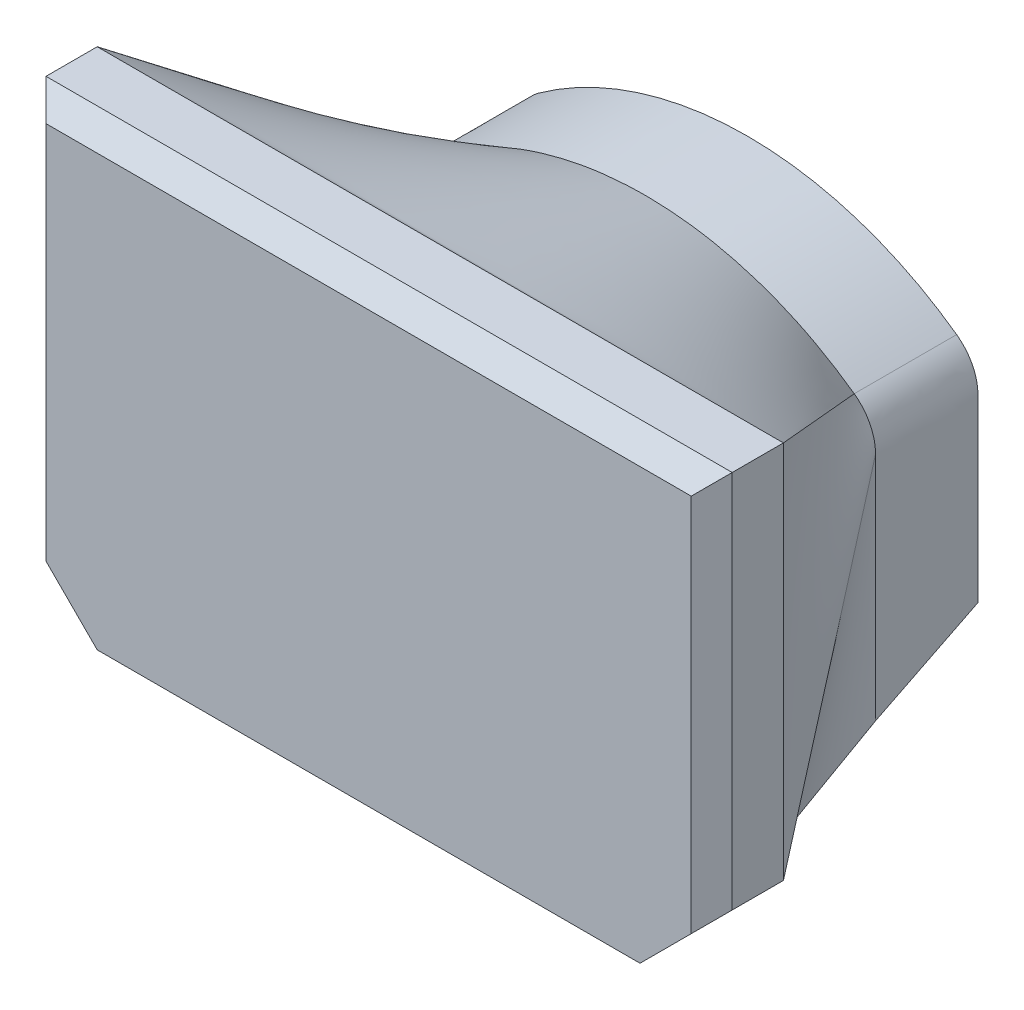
ISO-10303-21;
HEADER;
FILE_DESCRIPTION(('STEP AP214'),'2;1');
FILE_NAME('part.step','',(''),(''),'','','');
FILE_SCHEMA(('AUTOMOTIVE_DESIGN { 1 0 10303 214 1 1 1 1 }'));
ENDSEC;
DATA;
#1=APPLICATION_CONTEXT('core data for automotive mechanical design processes');
#2=APPLICATION_PROTOCOL_DEFINITION('international standard','automotive_design',2000,#1);
#3=PRODUCT_CONTEXT('',#1,'mechanical');
#4=PRODUCT('Part','Part','',(#3));
#5=PRODUCT_RELATED_PRODUCT_CATEGORY('part','',(#4));
#6=PRODUCT_DEFINITION_FORMATION('','',#4);
#7=PRODUCT_DEFINITION_CONTEXT('part definition',#1,'design');
#8=PRODUCT_DEFINITION('design','',#6,#7);
#9=PRODUCT_DEFINITION_SHAPE('','',#8);
#10=(LENGTH_UNIT() NAMED_UNIT(*) SI_UNIT(.MILLI.,.METRE.));
#11=(NAMED_UNIT(*) PLANE_ANGLE_UNIT() SI_UNIT($,.RADIAN.));
#12=(NAMED_UNIT(*) SI_UNIT($,.STERADIAN.) SOLID_ANGLE_UNIT());
#13=UNCERTAINTY_MEASURE_WITH_UNIT(LENGTH_MEASURE(1.E-05),#10,'distance_accuracy_value','');
#14=(GEOMETRIC_REPRESENTATION_CONTEXT(3) GLOBAL_UNCERTAINTY_ASSIGNED_CONTEXT((#13)) GLOBAL_UNIT_ASSIGNED_CONTEXT((#10,
#11,#12)) REPRESENTATION_CONTEXT('',''));
#15=CARTESIAN_POINT('',(0.,0.,0.));
#16=DIRECTION('',(0.,0.,1.));
#17=DIRECTION('',(1.,0.,0.));
#18=AXIS2_PLACEMENT_3D('',#15,#16,#17);
#19=CARTESIAN_POINT('',(-31.5,0.,0.));
#20=DIRECTION('',(0.,0.,-1.));
#21=DIRECTION('',(-1.,0.,0.));
#22=AXIS2_PLACEMENT_3D('',#19,#20,#21);
#23=PLANE('',#22);
#24=DIRECTION('',(1.,0.,0.));
#25=VECTOR('',#24,1.);
#26=CARTESIAN_POINT('',(-26.5,0.,0.));
#27=LINE('',#26,#25);
#28=CARTESIAN_POINT('',(-26.5,0.,0.));
#29=VERTEX_POINT('',#28);
#30=CARTESIAN_POINT('',(26.5,0.,0.));
#31=VERTEX_POINT('',#30);
#32=EDGE_CURVE('E406',#29,#31,#27,.T.);
#33=ORIENTED_EDGE('',*,*,#32,.T.);
#34=DIRECTION('',(0.707106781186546,0.707106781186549,0.));
#35=VECTOR('',#34,1.);
#36=CARTESIAN_POINT('',(26.5,0.,0.));
#37=LINE('',#36,#35);
#38=CARTESIAN_POINT('',(31.5,5.,0.));
#39=VERTEX_POINT('',#38);
#40=EDGE_CURVE('E398',#31,#39,#37,.T.);
#41=ORIENTED_EDGE('',*,*,#40,.T.);
#42=DIRECTION('',(0.,1.,0.));
#43=VECTOR('',#42,1.);
#44=CARTESIAN_POINT('',(31.5,42.,0.));
#45=LINE('',#44,#43);
#46=CARTESIAN_POINT('',(31.5,42.,0.));
#47=VERTEX_POINT('',#46);
#48=EDGE_CURVE('E380',#39,#47,#45,.T.);
#49=ORIENTED_EDGE('',*,*,#48,.T.);
#50=DIRECTION('',(-1.,0.,0.));
#51=VECTOR('',#50,1.);
#52=CARTESIAN_POINT('',(-31.5,42.,0.));
#53=LINE('',#52,#51);
#54=CARTESIAN_POINT('',(-31.5,42.,0.));
#55=VERTEX_POINT('',#54);
#56=EDGE_CURVE('E364',#47,#55,#53,.T.);
#57=ORIENTED_EDGE('',*,*,#56,.T.);
#58=DIRECTION('',(0.,-1.,0.));
#59=VECTOR('',#58,1.);
#60=CARTESIAN_POINT('',(-31.5,42.,0.));
#61=LINE('',#60,#59);
#62=CARTESIAN_POINT('',(-31.5,5.,0.));
#63=VERTEX_POINT('',#62);
#64=EDGE_CURVE('E257',#55,#63,#61,.T.);
#65=ORIENTED_EDGE('',*,*,#64,.T.);
#66=DIRECTION('',(0.707106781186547,-0.707106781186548,0.));
#67=VECTOR('',#66,1.);
#68=CARTESIAN_POINT('',(-31.5,5.,0.));
#69=LINE('',#68,#67);
#70=EDGE_CURVE('E12',#63,#29,#69,.T.);
#71=ORIENTED_EDGE('',*,*,#70,.T.);
#72=EDGE_LOOP('',(#33,#41,#49,#57,#65,#71));
#73=FACE_BOUND('',#72,.T.);
#74=ADVANCED_FACE('F242',(#73),#23,.F.);
#75=CARTESIAN_POINT('',(-26.5,0.,5.00000000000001));
#76=DIRECTION('',(-0.707106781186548,-0.707106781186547,0.));
#77=DIRECTION('',(0.707106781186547,-0.707106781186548,0.));
#78=AXIS2_PLACEMENT_3D('',#75,#76,#77);
#79=PLANE('',#78);
#80=DIRECTION('',(-0.577350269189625,0.577350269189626,-0.577350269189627));
#81=VECTOR('',#80,1.);
#82=CARTESIAN_POINT('',(-31.5,5.,0.));
#83=LINE('',#82,#81);
#84=CARTESIAN_POINT('',(-33.5,7.,-2.));
#85=VERTEX_POINT('',#84);
#86=EDGE_CURVE('E361',#63,#85,#83,.T.);
#87=ORIENTED_EDGE('',*,*,#86,.T.);
#88=DIRECTION('',(0.,0.,-1.));
#89=VECTOR('',#88,1.);
#90=CARTESIAN_POINT('',(-33.5,7.,-2.));
#91=LINE('',#90,#89);
#92=CARTESIAN_POINT('',(-33.5,7.,-7.));
#93=VERTEX_POINT('',#92);
#94=EDGE_CURVE('E675',#85,#93,#91,.T.);
#95=ORIENTED_EDGE('',*,*,#94,.T.);
#96=DIRECTION('',(0.707106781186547,-0.707106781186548,0.));
#97=VECTOR('',#96,1.);
#98=CARTESIAN_POINT('',(-33.5,7.,-7.));
#99=LINE('',#98,#97);
#100=CARTESIAN_POINT('',(-26.5,0.,-7.));
#101=VERTEX_POINT('',#100);
#102=EDGE_CURVE('E451',#93,#101,#99,.T.);
#103=ORIENTED_EDGE('',*,*,#102,.T.);
#104=DIRECTION('',(0.,0.,-1.));
#105=VECTOR('',#104,1.);
#106=CARTESIAN_POINT('',(-26.5,0.,0.));
#107=LINE('',#106,#105);
#108=EDGE_CURVE('E740',#29,#101,#107,.T.);
#109=ORIENTED_EDGE('',*,*,#108,.F.);
#110=ORIENTED_EDGE('',*,*,#70,.F.);
#111=EDGE_LOOP('',(#87,#95,#103,#109,#110));
#112=FACE_BOUND('',#111,.T.);
#113=ADVANCED_FACE('F697',(#112),#79,.T.);
#114=CARTESIAN_POINT('',(-26.5,0.,-2.));
#115=DIRECTION('',(0.,-1.,0.));
#116=DIRECTION('',(1.,0.,0.));
#117=AXIS2_PLACEMENT_3D('',#114,#115,#116);
#118=PLANE('',#117);
#119=ORIENTED_EDGE('',*,*,#108,.T.);
#120=DIRECTION('',(1.,0.,0.));
#121=VECTOR('',#120,1.);
#122=CARTESIAN_POINT('',(-26.5,0.,-7.));
#123=LINE('',#122,#121);
#124=CARTESIAN_POINT('',(26.5,0.,-7.));
#125=VERTEX_POINT('',#124);
#126=EDGE_CURVE('E421',#101,#125,#123,.T.);
#127=ORIENTED_EDGE('',*,*,#126,.T.);
#128=DIRECTION('',(0.,0.,-1.));
#129=VECTOR('',#128,1.);
#130=CARTESIAN_POINT('',(26.5,0.,0.));
#131=LINE('',#130,#129);
#132=EDGE_CURVE('E426',#31,#125,#131,.T.);
#133=ORIENTED_EDGE('',*,*,#132,.F.);
#134=ORIENTED_EDGE('',*,*,#32,.F.);
#135=EDGE_LOOP('',(#119,#127,#133,#134));
#136=FACE_BOUND('',#135,.T.);
#137=ADVANCED_FACE('F706',(#136),#118,.T.);
#138=CARTESIAN_POINT('',(-31.5,42.,0.));
#139=DIRECTION('',(-0.707106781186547,0.,0.707106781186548));
#140=DIRECTION('',(0.707106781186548,0.,0.707106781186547));
#141=AXIS2_PLACEMENT_3D('',#138,#139,#140);
#142=PLANE('',#141);
#143=DIRECTION('',(-0.577350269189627,0.577350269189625,-0.577350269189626));
#144=VECTOR('',#143,1.);
#145=CARTESIAN_POINT('',(-31.5,42.,0.));
#146=LINE('',#145,#144);
#147=CARTESIAN_POINT('',(-33.5,44.,-2.));
#148=VERTEX_POINT('',#147);
#149=EDGE_CURVE('E359',#55,#148,#146,.T.);
#150=ORIENTED_EDGE('',*,*,#149,.T.);
#151=DIRECTION('',(0.,-1.,0.));
#152=VECTOR('',#151,1.);
#153=CARTESIAN_POINT('',(-33.5,44.,-2.));
#154=LINE('',#153,#152);
#155=EDGE_CURVE('E424',#148,#85,#154,.T.);
#156=ORIENTED_EDGE('',*,*,#155,.T.);
#157=ORIENTED_EDGE('',*,*,#86,.F.);
#158=ORIENTED_EDGE('',*,*,#64,.F.);
#159=EDGE_LOOP('',(#150,#156,#157,#158));
#160=FACE_BOUND('',#159,.T.);
#161=ADVANCED_FACE('F357',(#160),#142,.T.);
#162=CARTESIAN_POINT('',(0.,10.5000000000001,31.5));
#163=DIRECTION('',(0.,0.707106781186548,0.707106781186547));
#164=DIRECTION('',(0.,-0.707106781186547,0.707106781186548));
#165=AXIS2_PLACEMENT_3D('',#162,#163,#164);
#166=PLANE('',#165);
#167=DIRECTION('',(0.577350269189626,0.577350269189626,-0.577350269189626));
#168=VECTOR('',#167,1.);
#169=CARTESIAN_POINT('',(31.5,42.,0.));
#170=LINE('',#169,#168);
#171=CARTESIAN_POINT('',(33.5,44.,-2.));
#172=VERTEX_POINT('',#171);
#173=EDGE_CURVE('E375',#47,#172,#170,.T.);
#174=ORIENTED_EDGE('',*,*,#173,.T.);
#175=DIRECTION('',(-1.,0.,0.));
#176=VECTOR('',#175,1.);
#177=CARTESIAN_POINT('',(33.5,44.,-2.));
#178=LINE('',#177,#176);
#179=EDGE_CURVE('E374',#172,#148,#178,.T.);
#180=ORIENTED_EDGE('',*,*,#179,.T.);
#181=ORIENTED_EDGE('',*,*,#149,.F.);
#182=ORIENTED_EDGE('',*,*,#56,.F.);
#183=EDGE_LOOP('',(#174,#180,#181,#182));
#184=FACE_BOUND('',#183,.T.);
#185=ADVANCED_FACE('F371',(#184),#166,.T.);
#186=CARTESIAN_POINT('',(33.5,7.,-2.));
#187=DIRECTION('',(0.707106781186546,0.,0.707106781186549));
#188=DIRECTION('',(0.707106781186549,0.,-0.707106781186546));
#189=AXIS2_PLACEMENT_3D('',#186,#187,#188);
#190=PLANE('',#189);
#191=DIRECTION('',(0.577350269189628,0.577350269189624,-0.577350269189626));
#192=VECTOR('',#191,1.);
#193=CARTESIAN_POINT('',(31.5,5.,0.));
#194=LINE('',#193,#192);
#195=CARTESIAN_POINT('',(33.5,7.,-2.));
#196=VERTEX_POINT('',#195);
#197=EDGE_CURVE('E768',#39,#196,#194,.T.);
#198=ORIENTED_EDGE('',*,*,#197,.T.);
#199=DIRECTION('',(0.,1.,0.));
#200=VECTOR('',#199,1.);
#201=CARTESIAN_POINT('',(33.5,7.,-2.));
#202=LINE('',#201,#200);
#203=EDGE_CURVE('E413',#196,#172,#202,.T.);
#204=ORIENTED_EDGE('',*,*,#203,.T.);
#205=ORIENTED_EDGE('',*,*,#173,.F.);
#206=ORIENTED_EDGE('',*,*,#48,.F.);
#207=EDGE_LOOP('',(#198,#204,#205,#206));
#208=FACE_BOUND('',#207,.T.);
#209=ADVANCED_FACE('F766',(#208),#190,.T.);
#210=CARTESIAN_POINT('',(26.5,0.,-2.));
#211=DIRECTION('',(0.707106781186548,-0.707106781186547,0.));
#212=DIRECTION('',(0.707106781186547,0.707106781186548,0.));
#213=AXIS2_PLACEMENT_3D('',#210,#211,#212);
#214=PLANE('',#213);
#215=ORIENTED_EDGE('',*,*,#132,.T.);
#216=DIRECTION('',(0.707106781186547,0.707106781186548,0.));
#217=VECTOR('',#216,1.);
#218=CARTESIAN_POINT('',(26.5,0.,-7.));
#219=LINE('',#218,#217);
#220=CARTESIAN_POINT('',(33.5,7.,-7.));
#221=VERTEX_POINT('',#220);
#222=EDGE_CURVE('E432',#125,#221,#219,.T.);
#223=ORIENTED_EDGE('',*,*,#222,.T.);
#224=DIRECTION('',(0.,0.,-1.));
#225=VECTOR('',#224,1.);
#226=CARTESIAN_POINT('',(33.5,7.,-2.));
#227=LINE('',#226,#225);
#228=EDGE_CURVE('E672',#196,#221,#227,.T.);
#229=ORIENTED_EDGE('',*,*,#228,.F.);
#230=ORIENTED_EDGE('',*,*,#197,.F.);
#231=ORIENTED_EDGE('',*,*,#40,.F.);
#232=EDGE_LOOP('',(#215,#223,#229,#230,#231));
#233=FACE_BOUND('',#232,.T.);
#234=ADVANCED_FACE('F790',(#233),#214,.T.);
#235=CARTESIAN_POINT('',(33.5,7.,-7.));
#236=DIRECTION('',(1.,0.,0.));
#237=DIRECTION('',(0.,0.,-1.));
#238=AXIS2_PLACEMENT_3D('',#235,#236,#237);
#239=PLANE('',#238);
#240=ORIENTED_EDGE('',*,*,#228,.T.);
#241=DIRECTION('',(0.,1.,0.));
#242=VECTOR('',#241,1.);
#243=CARTESIAN_POINT('',(33.5,7.,-7.));
#244=LINE('',#243,#242);
#245=CARTESIAN_POINT('',(33.5,44.,-7.));
#246=VERTEX_POINT('',#245);
#247=EDGE_CURVE('E435',#221,#246,#244,.T.);
#248=ORIENTED_EDGE('',*,*,#247,.T.);
#249=DIRECTION('',(0.,0.,-1.));
#250=VECTOR('',#249,1.);
#251=CARTESIAN_POINT('',(33.5,44.,-2.));
#252=LINE('',#251,#250);
#253=EDGE_CURVE('E436',#172,#246,#252,.T.);
#254=ORIENTED_EDGE('',*,*,#253,.F.);
#255=ORIENTED_EDGE('',*,*,#203,.F.);
#256=EDGE_LOOP('',(#240,#248,#254,#255));
#257=FACE_BOUND('',#256,.T.);
#258=ADVANCED_FACE('F707',(#257),#239,.T.);
#259=CARTESIAN_POINT('',(33.5,44.,-7.));
#260=DIRECTION('',(0.,1.,0.));
#261=DIRECTION('',(-1.,0.,0.));
#262=AXIS2_PLACEMENT_3D('',#259,#260,#261);
#263=PLANE('',#262);
#264=ORIENTED_EDGE('',*,*,#253,.T.);
#265=DIRECTION('',(-1.,0.,0.));
#266=VECTOR('',#265,1.);
#267=CARTESIAN_POINT('',(33.5,44.,-7.));
#268=LINE('',#267,#266);
#269=CARTESIAN_POINT('',(-33.5,44.,-7.));
#270=VERTEX_POINT('',#269);
#271=EDGE_CURVE('E441',#246,#270,#268,.T.);
#272=ORIENTED_EDGE('',*,*,#271,.T.);
#273=DIRECTION('',(0.,0.,-1.));
#274=VECTOR('',#273,1.);
#275=CARTESIAN_POINT('',(-33.5,44.,-2.));
#276=LINE('',#275,#274);
#277=EDGE_CURVE('E665',#148,#270,#276,.T.);
#278=ORIENTED_EDGE('',*,*,#277,.F.);
#279=ORIENTED_EDGE('',*,*,#179,.F.);
#280=EDGE_LOOP('',(#264,#272,#278,#279));
#281=FACE_BOUND('',#280,.T.);
#282=ADVANCED_FACE('F759',(#281),#263,.T.);
#283=CARTESIAN_POINT('',(-33.5,44.,-7.));
#284=DIRECTION('',(-1.,0.,0.));
#285=DIRECTION('',(0.,-1.,0.));
#286=AXIS2_PLACEMENT_3D('',#283,#284,#285);
#287=PLANE('',#286);
#288=ORIENTED_EDGE('',*,*,#277,.T.);
#289=DIRECTION('',(0.,-1.,0.));
#290=VECTOR('',#289,1.);
#291=CARTESIAN_POINT('',(-33.5,44.,-7.));
#292=LINE('',#291,#290);
#293=EDGE_CURVE('E446',#270,#93,#292,.T.);
#294=ORIENTED_EDGE('',*,*,#293,.T.);
#295=ORIENTED_EDGE('',*,*,#94,.F.);
#296=ORIENTED_EDGE('',*,*,#155,.F.);
#297=EDGE_LOOP('',(#288,#294,#295,#296));
#298=FACE_BOUND('',#297,.T.);
#299=ADVANCED_FACE('F753',(#298),#287,.T.);
#300=CARTESIAN_POINT('',(-26.5,0.,-7.));
#301=CARTESIAN_POINT('',(-22.5,5.,-27.));
#302=CARTESIAN_POINT('',(-27.6666666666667,1.16666666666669,-7.));
#303=CARTESIAN_POINT('',(-22.5,8.75957877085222,-27.));
#304=CARTESIAN_POINT('',(-28.8333333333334,2.33333333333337,-7.));
#305=CARTESIAN_POINT('',(-22.5,12.5191575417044,-27.));
#306=CARTESIAN_POINT('',(-31.1666666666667,4.6666666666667,-7.));
#307=CARTESIAN_POINT('',(-22.5,20.0383150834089,-27.));
#308=CARTESIAN_POINT('',(-32.3333333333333,5.83333333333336,-7.));
#309=CARTESIAN_POINT('',(-22.5,23.7978938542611,-27.));
#310=CARTESIAN_POINT('',(-33.5,7.,-7.));
#311=CARTESIAN_POINT('',(-22.5,27.5574726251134,-27.));
#312=B_SPLINE_SURFACE_WITH_KNOTS('',3,1,((#300,#301),(#302,#303),(#304,#305),(#306,#307),(#308,
#309),(#310,#311)),.UNSPECIFIED.,.F.,.F.,.F.,(4,2,4),(2,2),(0.,0.5,1.),(0.,1.),.UNSPECIFIED.);
#313=DIRECTION('',(0.358093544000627,0.669227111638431,-0.651079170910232));
#314=VECTOR('',#313,1.);
#315=CARTESIAN_POINT('',(-28.,17.2787363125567,-17.));
#316=LINE('',#315,#314);
#317=CARTESIAN_POINT('',(-22.4999999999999,27.5574726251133,-27.));
#318=VERTEX_POINT('',#317);
#319=EDGE_CURVE('E660',#93,#318,#316,.T.);
#320=DIRECTION('',(0.,-1.,0.));
#321=VECTOR('',#320,1.);
#322=CARTESIAN_POINT('',(-22.5,27.5574726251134,-27.));
#323=LINE('',#322,#321);
#324=CARTESIAN_POINT('',(-22.5,5.,-27.));
#325=VERTEX_POINT('',#324);
#326=EDGE_CURVE('E534',#318,#325,#323,.T.);
#327=DIRECTION('',(-0.190476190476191,-0.238095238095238,0.952380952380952));
#328=VECTOR('',#327,1.);
#329=CARTESIAN_POINT('',(-24.5,2.5,-17.));
#330=LINE('',#329,#328);
#331=EDGE_CURVE('E657',#325,#101,#330,.T.);
#332=ORIENTED_EDGE('',*,*,#102,.F.);
#333=ORIENTED_EDGE('',*,*,#319,.T.);
#334=ORIENTED_EDGE('',*,*,#326,.T.);
#335=ORIENTED_EDGE('',*,*,#331,.T.);
#336=EDGE_LOOP('',(#332,#333,#334,#335));
#337=FACE_BOUND('',#336,.T.);
#338=ADVANCED_FACE('F518',(#337),#312,.T.);
#339=CARTESIAN_POINT('',(-33.5,7.,-7.));
#340=CARTESIAN_POINT('',(-22.5,27.5574726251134,-27.));
#341=CARTESIAN_POINT('',(-22.39,27.7630473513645,-27.2));
#342=CARTESIAN_POINT('',(-33.5,10.0833333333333,-7.));
#343=CARTESIAN_POINT('',(-22.5,27.9378355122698,-27.));
#344=CARTESIAN_POINT('',(-22.39,28.1163805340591,-27.2));
#345=CARTESIAN_POINT('',(-33.5,13.1666666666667,-7.));
#346=CARTESIAN_POINT('',(-22.4560271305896,28.3289764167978,-27.));
#347=CARTESIAN_POINT('',(-22.3455874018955,28.4805995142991,-27.2));
#348=CARTESIAN_POINT('',(-33.5,19.3333333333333,-7.));
#349=CARTESIAN_POINT('',(-22.2723259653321,29.1009517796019,-27.));
#350=CARTESIAN_POINT('',(-22.1600492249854,29.1986279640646,-27.2));
#351=CARTESIAN_POINT('',(-33.5,22.4166666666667,-7.));
#352=CARTESIAN_POINT('',(-22.1325217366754,29.4814764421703,-27.));
#353=CARTESIAN_POINT('',(-22.0188469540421,29.5521245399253,-27.2));
#354=CARTESIAN_POINT('',(-33.5,28.5833333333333,-7.));
#355=CARTESIAN_POINT('',(-21.7650434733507,30.1978234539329,-27.));
#356=CARTESIAN_POINT('',(-21.6476939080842,30.2139683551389,-27.2));
#357=CARTESIAN_POINT('',(-33.5,31.6666666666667,-7.));
#358=CARTESIAN_POINT('',(-21.537521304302,30.5333497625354,-27.));
#359=CARTESIAN_POINT('',(-21.417896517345,30.522016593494,-27.2));
#360=CARTESIAN_POINT('',(-33.5,37.8333333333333,-7.));
#361=CARTESIAN_POINT('',(-21.0176565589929,31.1328768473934,-27.));
#362=CARTESIAN_POINT('',(-20.8928331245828,31.065872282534,-27.2));
#363=CARTESIAN_POINT('',(-33.5,40.9166666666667,-7.));
#364=CARTESIAN_POINT('',(-20.7256099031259,31.3967585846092,-27.));
#365=CARTESIAN_POINT('',(-20.5978660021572,31.3015595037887,-27.2));
#366=CARTESIAN_POINT('',(-33.5,44.,-7.));
#367=CARTESIAN_POINT('',(-20.4166666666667,31.6186369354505,-27.));
#368=CARTESIAN_POINT('',(-20.2858333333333,31.494823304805,-27.2));
#369=B_SPLINE_SURFACE_WITH_KNOTS('',3,1,((#339,#340,#341),(#342,#343,#344),(#345,#346,#347),
(#348,#349,#350),(#351,#352,#353),(#354,#355,#356),(#357,#358,#359),(#360,#361,#362),(#363,#364,
#365),(#366,#367,#368)),.UNSPECIFIED.,.F.,.F.,.F.,(4,2,2,2,4),(2,1,2),(0.,0.25,0.5,0.75,1.),(0.,
1.,1.01),.UNSPECIFIED.);
#370=DIRECTION('',(0.486079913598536,-0.459999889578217,-0.743052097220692));
#371=VECTOR('',#370,1.);
#372=CARTESIAN_POINT('',(-26.9583333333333,37.8093184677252,-17.));
#373=LINE('',#372,#371);
#374=CARTESIAN_POINT('',(-20.4166666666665,31.6186369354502,-27.));
#375=VERTEX_POINT('',#374);
#376=EDGE_CURVE('E645',#270,#375,#373,.T.);
#377=CARTESIAN_POINT('',(-20.4166666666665,31.6186369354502,-27.));
#378=CARTESIAN_POINT('',(-20.4737752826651,31.5776255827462,-26.9999968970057));
#379=CARTESIAN_POINT('',(-20.5300224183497,31.5354137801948,-26.9999658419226));
#380=CARTESIAN_POINT('',(-20.6406879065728,31.4486575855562,-26.9998919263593));
#381=CARTESIAN_POINT('',(-20.6951062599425,31.4041131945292,-26.9998490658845));
#382=CARTESIAN_POINT('',(-20.802005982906,31.3127621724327,-26.9997956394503));
#383=CARTESIAN_POINT('',(-20.8544874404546,31.2659556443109,-26.9997850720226));
#384=CARTESIAN_POINT('',(-20.9574209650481,31.1701631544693,-26.9998083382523));
#385=CARTESIAN_POINT('',(-21.0078730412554,31.1211772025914,-26.9998421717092));
#386=CARTESIAN_POINT('',(-21.1066099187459,31.021169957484,-26.9999410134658));
#387=CARTESIAN_POINT('',(-21.1548969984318,30.9701509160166,-27.000005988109));
#388=CARTESIAN_POINT('',(-21.2492880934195,30.8661402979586,-27.0000804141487));
#389=CARTESIAN_POINT('',(-21.2953920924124,30.8131487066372,-27.0000898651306));
#390=CARTESIAN_POINT('',(-21.4303120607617,30.6513392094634,-26.999999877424));
#391=CARTESIAN_POINT('',(-21.515759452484,30.5396628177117,-26.9997821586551));
#392=CARTESIAN_POINT('',(-21.6366243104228,30.3670334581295,-26.999657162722));
#393=CARTESIAN_POINT('',(-21.6757132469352,30.3086062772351,-26.9996491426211));
#394=CARTESIAN_POINT('',(-21.7513897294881,30.1901456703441,-26.9996960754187));
#395=CARTESIAN_POINT('',(-21.7879772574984,30.130112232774,-26.9997510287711));
#396=CARTESIAN_POINT('',(-21.8585865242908,30.0085555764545,-26.9998838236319));
#397=CARTESIAN_POINT('',(-21.8926082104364,29.9470323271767,-26.9999616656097));
#398=CARTESIAN_POINT('',(-21.9580395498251,29.8226118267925,-27.00000009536));
#399=CARTESIAN_POINT('',(-21.9894492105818,29.759714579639,-26.9999606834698));
#400=CARTESIAN_POINT('',(-22.0495728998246,29.6326759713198,-26.999848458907));
#401=CARTESIAN_POINT('',(-22.0782880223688,29.5685351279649,-26.9997756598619));
#402=CARTESIAN_POINT('',(-22.1329793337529,29.4390958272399,-26.9996926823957));
#403=CARTESIAN_POINT('',(-22.1589555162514,29.3737973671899,-26.9996825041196));
#404=CARTESIAN_POINT('',(-22.2081225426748,29.2421675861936,-26.9997435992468));
#405=CARTESIAN_POINT('',(-22.2313136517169,29.1758363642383,-26.9998148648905));
#406=CARTESIAN_POINT('',(-22.2748826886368,29.0422576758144,-26.9999916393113));
#407=CARTESIAN_POINT('',(-22.2952606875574,28.9750102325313,-27.0000971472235));
#408=CARTESIAN_POINT('',(-22.3296056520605,28.8525222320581,-27.0002013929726));
#409=CARTESIAN_POINT('',(-22.3440561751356,28.7974166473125,-27.0002165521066));
#410=CARTESIAN_POINT('',(-22.3710894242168,28.6867506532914,-27.0001232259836));
#411=CARTESIAN_POINT('',(-22.3836722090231,28.6311902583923,-27.00001474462));
#412=CARTESIAN_POINT('',(-22.4069284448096,28.5196794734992,-26.9997904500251));
#413=CARTESIAN_POINT('',(-22.417602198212,28.4637291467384,-26.9996746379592));
#414=CARTESIAN_POINT('',(-22.4370185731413,28.3514975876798,-26.9994930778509));
#415=CARTESIAN_POINT('',(-22.4457611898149,28.2952163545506,-26.9994273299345));
#416=CARTESIAN_POINT('',(-22.4690628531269,28.1259754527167,-26.9993504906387));
#417=CARTESIAN_POINT('',(-22.480700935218,28.012593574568,-26.9994597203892));
#418=CARTESIAN_POINT('',(-22.4923032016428,27.8421389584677,-26.9997031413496));
#419=CARTESIAN_POINT('',(-22.4951948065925,27.7852455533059,-26.9997975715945));
#420=CARTESIAN_POINT('',(-22.4990434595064,27.6713942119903,-26.9999459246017));
#421=CARTESIAN_POINT('',(-22.5000005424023,27.6144362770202,-26.9999998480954));
#422=CARTESIAN_POINT('',(-22.4999999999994,27.5574726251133,-27.));
#423=B_SPLINE_CURVE_WITH_KNOTS('',3,(#377,#378,#379,#380,#381,#382,#383,#384,#385,#386,#387,
#388,#389,#390,#391,#392,#393,#394,#395,#396,#397,#398,#399,#400,#401,#402,#403,#404,#405,#406,
#407,#408,#409,#410,#411,#412,#413,#414,#415,#416,#417,#418,#419,#420,#421,#422),.UNSPECIFIED.,
.F.,.F.,(4,2,2,2,2,2,2,2,2,2,2,2,2,2,2,2,2,2,2,2,2,2,4),(0.,0.210911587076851,0.42182307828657,
0.632724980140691,0.843625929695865,1.05429945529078,1.26497455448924,1.68622489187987,
1.89706865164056,2.10791393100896,2.3187635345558,2.52961253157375,2.7403755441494,
2.95113904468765,3.16188246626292,3.37262056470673,3.54349575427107,3.71436556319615,
3.88520827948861,4.05605142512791,4.39766123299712,4.56853539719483,4.73940647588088),.UNSPECIFIED.);
#424=EDGE_CURVE('E528',#375,#318,#423,.T.);
#425=ORIENTED_EDGE('',*,*,#293,.F.);
#426=ORIENTED_EDGE('',*,*,#376,.T.);
#427=ORIENTED_EDGE('',*,*,#424,.T.);
#428=ORIENTED_EDGE('',*,*,#319,.F.);
#429=EDGE_LOOP('',(#425,#426,#427,#428));
#430=FACE_BOUND('',#429,.T.);
#431=ADVANCED_FACE('F511',(#430),#369,.T.);
#432=CARTESIAN_POINT('',(-26.5,0.,-7.));
#433=DIRECTION('',(0.,-0.970142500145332,-0.242535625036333));
#434=DIRECTION('',(0.,0.242535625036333,-0.970142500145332));
#435=AXIS2_PLACEMENT_3D('',#432,#433,#434);
#436=PLANE('',#435);
#437=ORIENTED_EDGE('',*,*,#331,.F.);
#438=DIRECTION('',(1.,0.,0.));
#439=VECTOR('',#438,1.);
#440=CARTESIAN_POINT('',(-22.5,5.,-27.));
#441=LINE('',#440,#439);
#442=CARTESIAN_POINT('',(22.5,5.,-27.));
#443=VERTEX_POINT('',#442);
#444=EDGE_CURVE('E815',#325,#443,#441,.T.);
#445=ORIENTED_EDGE('',*,*,#444,.T.);
#446=DIRECTION('',(-0.190476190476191,0.238095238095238,-0.952380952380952));
#447=VECTOR('',#446,1.);
#448=CARTESIAN_POINT('',(24.5,2.5,-17.));
#449=LINE('',#448,#447);
#450=EDGE_CURVE('E465',#125,#443,#449,.T.);
#451=ORIENTED_EDGE('',*,*,#450,.F.);
#452=ORIENTED_EDGE('',*,*,#126,.F.);
#453=EDGE_LOOP('',(#437,#445,#451,#452));
#454=FACE_BOUND('',#453,.T.);
#455=ADVANCED_FACE('F502',(#454),#436,.T.);
#456=CARTESIAN_POINT('',(-33.5,44.,-7.));
#457=CARTESIAN_POINT('',(-20.4166666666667,31.6186369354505,-27.));
#458=CARTESIAN_POINT('',(-20.2858333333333,31.494823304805,-27.2));
#459=CARTESIAN_POINT('',(-30.7083333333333,44.,-7.));
#460=CARTESIAN_POINT('',(-19.0347426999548,32.6111137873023,-27.));
#461=CARTESIAN_POINT('',(-18.918006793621,32.4972249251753,-27.2));
#462=CARTESIAN_POINT('',(-27.9166666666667,44.,-7.));
#463=CARTESIAN_POINT('',(-17.5472286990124,33.5259904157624,-27.));
#464=CARTESIAN_POINT('',(-17.4435343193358,33.42125031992,-27.2));
#465=CARTESIAN_POINT('',(-22.3333333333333,44.,-7.));
#466=CARTESIAN_POINT('',(-14.3895442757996,35.1449705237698,-27.));
#467=CARTESIAN_POINT('',(-14.3101063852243,35.0564202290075,-27.2));
#468=CARTESIAN_POINT('',(-19.5416666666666,44.,-7.));
#469=CARTESIAN_POINT('',(-12.7194144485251,35.8488142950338,-27.));
#470=CARTESIAN_POINT('',(-12.6511919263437,35.7673024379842,-27.2));
#471=CARTESIAN_POINT('',(-13.9583333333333,44.,-7.));
#472=CARTESIAN_POINT('',(-9.24373646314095,36.997338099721,-27.));
#473=CARTESIAN_POINT('',(-9.19659049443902,36.9273114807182,-27.2));
#474=CARTESIAN_POINT('',(-11.1666666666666,44.,-7.));
#475=CARTESIAN_POINT('',(-7.4383551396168,37.4417830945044,-27.));
#476=CARTESIAN_POINT('',(-7.4010720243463,37.3762009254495,-27.2));
#477=CARTESIAN_POINT('',(-5.5833333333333,44.,-7.));
#478=CARTESIAN_POINT('',(-3.75518730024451,38.0384278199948,-27.));
#479=CARTESIAN_POINT('',(-3.73690583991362,37.9788120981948,-27.2));
#480=CARTESIAN_POINT('',(-2.79166666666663,44.,-7.));
#481=CARTESIAN_POINT('',(-1.87767137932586,38.190486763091,-27.));
#482=CARTESIAN_POINT('',(-1.86853142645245,38.1323916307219,-27.2));
#483=CARTESIAN_POINT('',(2.7916666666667,44.,-7.));
#484=CARTESIAN_POINT('',(1.87767137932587,38.190486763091,-27.));
#485=CARTESIAN_POINT('',(1.86853142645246,38.1323916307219,-27.2));
#486=CARTESIAN_POINT('',(5.58333333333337,44.,-7.));
#487=CARTESIAN_POINT('',(3.75518730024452,38.0384278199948,-27.));
#488=CARTESIAN_POINT('',(3.73690583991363,37.9788120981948,-27.2));
#489=CARTESIAN_POINT('',(11.1666666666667,44.,-7.));
#490=CARTESIAN_POINT('',(7.43835513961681,37.4417830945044,-27.));
#491=CARTESIAN_POINT('',(7.40107202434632,37.3762009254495,-27.2));
#492=CARTESIAN_POINT('',(13.9583333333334,44.,-7.));
#493=CARTESIAN_POINT('',(9.24373646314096,36.997338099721,-27.));
#494=CARTESIAN_POINT('',(9.19659049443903,36.9273114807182,-27.2));
#495=CARTESIAN_POINT('',(19.5416666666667,44.,-7.));
#496=CARTESIAN_POINT('',(12.7194144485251,35.8488142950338,-27.));
#497=CARTESIAN_POINT('',(12.6511919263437,35.7673024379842,-27.2));
#498=CARTESIAN_POINT('',(22.3333333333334,44.,-7.));
#499=CARTESIAN_POINT('',(14.3895442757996,35.1449705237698,-27.));
#500=CARTESIAN_POINT('',(14.3101063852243,35.0564202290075,-27.2));
#501=CARTESIAN_POINT('',(27.9166666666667,44.,-7.));
#502=CARTESIAN_POINT('',(17.5472286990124,33.5259904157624,-27.));
#503=CARTESIAN_POINT('',(17.4435343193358,33.42125031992,-27.2));
#504=CARTESIAN_POINT('',(30.7083333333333,44.,-7.));
#505=CARTESIAN_POINT('',(19.0347426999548,32.6111137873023,-27.));
#506=CARTESIAN_POINT('',(18.918006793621,32.4972249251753,-27.2));
#507=CARTESIAN_POINT('',(33.5,44.,-7.));
#508=CARTESIAN_POINT('',(20.4166666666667,31.6186369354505,-27.));
#509=CARTESIAN_POINT('',(20.2858333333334,31.494823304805,-27.2));
#510=B_SPLINE_SURFACE_WITH_KNOTS('',3,1,((#456,#457,#458),(#459,#460,#461),(#462,#463,#464),
(#465,#466,#467),(#468,#469,#470),(#471,#472,#473),(#474,#475,#476),(#477,#478,#479),(#480,#481,
#482),(#483,#484,#485),(#486,#487,#488),(#489,#490,#491),(#492,#493,#494),(#495,#496,#497),
(#498,#499,#500),(#501,#502,#503),(#504,#505,#506),(#507,#508,#509)),.UNSPECIFIED.,.F.,.F.,.F.,
(4,2,2,2,2,2,2,2,4),(2,1,2),(0.,0.125,0.25,0.375,0.5,0.625,0.75,0.875,1.),(0.,1.,1.01),.UNSPECIFIED.);
#511=DIRECTION('',(-0.486079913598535,-0.459999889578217,-0.743052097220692));
#512=VECTOR('',#511,1.);
#513=CARTESIAN_POINT('',(26.9583333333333,37.8093184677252,-17.));
#514=LINE('',#513,#512);
#515=CARTESIAN_POINT('',(20.4166666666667,31.6186369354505,-27.));
#516=VERTEX_POINT('',#515);
#517=EDGE_CURVE('E637',#246,#516,#514,.T.);
#518=CARTESIAN_POINT('',(20.4166666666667,31.6186369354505,-27.));
#519=CARTESIAN_POINT('',(20.1571865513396,31.8049916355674,-26.9999990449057));
#520=CARTESIAN_POINT('',(19.895166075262,31.9877801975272,-26.9999830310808));
#521=CARTESIAN_POINT('',(19.3662166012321,32.3461106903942,-26.9999515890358));
#522=CARTESIAN_POINT('',(19.0992876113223,32.5216526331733,-26.9999361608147));
#523=CARTESIAN_POINT('',(18.2914675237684,33.0371915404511,-26.9999368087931));
#524=CARTESIAN_POINT('',(17.7434732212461,33.366151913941,-26.9999998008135));
#525=CARTESIAN_POINT('',(16.6303560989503,33.9935750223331,-27.0001492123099));
#526=CARTESIAN_POINT('',(16.0652334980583,34.292038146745,-27.0002356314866));
#527=CARTESIAN_POINT('',(14.9196778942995,34.8575368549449,-27.0001450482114));
#528=CARTESIAN_POINT('',(14.3392504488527,35.1245836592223,-26.9999681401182));
#529=CARTESIAN_POINT('',(13.458382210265,35.501031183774,-26.9998064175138));
#530=CARTESIAN_POINT('',(13.1630407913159,35.6224984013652,-26.9997697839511));
#531=CARTESIAN_POINT('',(12.5691404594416,35.8573099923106,-26.9997214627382));
#532=CARTESIAN_POINT('',(12.2705815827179,35.970654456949,-26.9997097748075));
#533=CARTESIAN_POINT('',(11.6704758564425,36.1891252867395,-26.9996950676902));
#534=CARTESIAN_POINT('',(11.3689290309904,36.2942517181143,-26.9996920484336));
#535=CARTESIAN_POINT('',(10.7630581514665,36.4962011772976,-26.9996144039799));
#536=CARTESIAN_POINT('',(10.4587339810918,36.5930238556,-26.9995397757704));
#537=CARTESIAN_POINT('',(9.6823039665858,36.8283694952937,-26.9993712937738));
#538=CARTESIAN_POINT('',(9.20843985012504,36.9611369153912,-26.9992888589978));
#539=CARTESIAN_POINT('',(8.25551675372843,37.20656683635,-26.9993427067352));
#540=CARTESIAN_POINT('',(7.7764574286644,37.319227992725,-26.9994790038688));
#541=CARTESIAN_POINT('',(6.81399044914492,37.5242664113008,-26.9998944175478));
#542=CARTESIAN_POINT('',(6.33058272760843,37.6166433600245,-27.0001735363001));
#543=CARTESIAN_POINT('',(5.60291125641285,37.7398749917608,-27.0003375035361));
#544=CARTESIAN_POINT('',(5.35992276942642,37.7783971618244,-27.0003497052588));
#545=CARTESIAN_POINT('',(4.87318858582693,37.85031683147,-27.0002838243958));
#546=CARTESIAN_POINT('',(4.62944288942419,37.8837143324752,-27.0002057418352));
#547=CARTESIAN_POINT('',(3.89730782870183,37.9761863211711,-26.9999444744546));
#548=CARTESIAN_POINT('',(3.40792280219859,38.0275568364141,-26.9997342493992));
#549=CARTESIAN_POINT('',(2.42743709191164,38.1096386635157,-26.9994976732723));
#550=CARTESIAN_POINT('',(1.936336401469,38.1403498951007,-26.9994713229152));
#551=CARTESIAN_POINT('',(0.953287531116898,38.1810366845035,-26.9995365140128));
#552=CARTESIAN_POINT('',(0.461339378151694,38.1910128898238,-26.999628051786));
#553=CARTESIAN_POINT('',(-0.522538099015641,38.1901638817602,-26.9995795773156));
#554=CARTESIAN_POINT('',(-1.01446742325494,38.1793387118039,-26.9994395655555));
#555=CARTESIAN_POINT('',(-1.99743276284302,38.1369407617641,-26.9993529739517));
#556=CARTESIAN_POINT('',(-2.48846876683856,38.1053677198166,-26.9994063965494));
#557=CARTESIAN_POINT('',(-3.468791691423,38.0215604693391,-26.9997083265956));
#558=CARTESIAN_POINT('',(-3.95807860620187,37.9693261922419,-26.9999568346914));
#559=CARTESIAN_POINT('',(-4.69001923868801,37.8755653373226,-27.0002610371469));
#560=CARTESIAN_POINT('',(-4.933682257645,37.8417410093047,-27.0003510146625));
#561=CARTESIAN_POINT('',(-5.42024235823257,37.7689709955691,-27.0004300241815));
#562=CARTESIAN_POINT('',(-5.66313943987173,37.7300253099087,-27.0004190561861));
#563=CARTESIAN_POINT('',(-6.39051200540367,37.6055316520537,-27.0002599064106));
#564=CARTESIAN_POINT('',(-6.87369913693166,37.512323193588,-26.9999854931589));
#565=CARTESIAN_POINT('',(-7.835634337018,37.3056561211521,-26.9995558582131));
#566=CARTESIAN_POINT('',(-8.31438303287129,37.1922004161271,-26.999400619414));
#567=CARTESIAN_POINT('',(-9.26668773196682,36.9452018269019,-26.999299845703));
#568=CARTESIAN_POINT('',(-9.74024361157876,36.8116584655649,-26.9993543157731));
#569=CARTESIAN_POINT('',(-10.6812065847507,36.5246988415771,-26.9994650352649));
#570=CARTESIAN_POINT('',(-11.1486147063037,36.371285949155,-26.9995212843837));
#571=CARTESIAN_POINT('',(-12.0764903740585,36.0448694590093,-26.9996017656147));
#572=CARTESIAN_POINT('',(-12.5369585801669,35.8718677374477,-26.9996260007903));
#573=CARTESIAN_POINT('',(-13.4317143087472,35.5140090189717,-26.999769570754));
#574=CARTESIAN_POINT('',(-13.8663072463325,35.3299150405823,-26.9998850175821));
#575=CARTESIAN_POINT('',(-14.7276345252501,34.9443547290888,-27.0001341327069));
#576=CARTESIAN_POINT('',(-15.1543701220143,34.7428912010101,-27.0002677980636));
#577=CARTESIAN_POINT('',(-15.9993273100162,34.322919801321,-27.0003617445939));
#578=CARTESIAN_POINT('',(-16.4175495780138,34.1044132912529,-27.0003220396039));
#579=CARTESIAN_POINT('',(-17.2442442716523,33.6510166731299,-27.0001980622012));
#580=CARTESIAN_POINT('',(-17.6527297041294,33.4161502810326,-27.0001138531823));
#581=CARTESIAN_POINT('',(-18.4599229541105,32.9301080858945,-27.0000080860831));
#582=CARTESIAN_POINT('',(-18.858630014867,32.678931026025,-26.9999865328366));
#583=CARTESIAN_POINT('',(-19.6456373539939,32.1606351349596,-26.9999761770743));
#584=CARTESIAN_POINT('',(-20.033935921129,31.8935137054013,-26.9999873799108));
#585=CARTESIAN_POINT('',(-20.4166666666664,31.6186369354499,-27.));
#586=B_SPLINE_CURVE_WITH_KNOTS('',3,(#518,#519,#520,#521,#522,#523,#524,#525,#526,#527,#528,
#529,#530,#531,#532,#533,#534,#535,#536,#537,#538,#539,#540,#541,#542,#543,#544,#545,#546,#547,
#548,#549,#550,#551,#552,#553,#554,#555,#556,#557,#558,#559,#560,#561,#562,#563,#564,#565,#566,
#567,#568,#569,#570,#571,#572,#573,#574,#575,#576,#577,#578,#579,#580,#581,#582,#583,#584,#585),
.UNSPECIFIED.,.F.,.F.,(4,2,2,2,2,2,2,2,2,2,2,2,2,2,2,2,2,2,2,2,2,2,2,2,2,2,2,2,2,2,2,2,2,4),(0.,
0.958331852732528,1.91666213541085,3.83306419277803,5.74944177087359,7.66513281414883,
8.62306863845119,9.58099369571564,10.5389110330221,11.4968686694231,12.9727353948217,
14.4487007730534,15.9246889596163,16.6627113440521,17.4007335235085,18.8764808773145,
20.3522339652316,21.8279409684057,23.3036448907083,24.7793674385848,26.2550948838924,
26.9930463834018,27.7309978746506,29.2068092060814,30.6824086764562,32.1580432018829,
33.6334277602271,35.1086711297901,36.5242176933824,37.9395360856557,39.3547415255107,
40.7679364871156,42.1812404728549,43.5947754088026),.UNSPECIFIED.);
#587=EDGE_CURVE('E246',#516,#375,#586,.T.);
#588=ORIENTED_EDGE('',*,*,#271,.F.);
#589=ORIENTED_EDGE('',*,*,#517,.T.);
#590=ORIENTED_EDGE('',*,*,#587,.T.);
#591=ORIENTED_EDGE('',*,*,#376,.F.);
#592=EDGE_LOOP('',(#588,#589,#590,#591));
#593=FACE_BOUND('',#592,.T.);
#594=ADVANCED_FACE('F488',(#593),#510,.T.);
#595=CARTESIAN_POINT('',(33.5,44.,-7.));
#596=CARTESIAN_POINT('',(20.4166666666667,31.6186369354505,-27.));
#597=CARTESIAN_POINT('',(20.2858333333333,31.494823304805,-27.2));
#598=CARTESIAN_POINT('',(33.5,40.9166666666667,-7.));
#599=CARTESIAN_POINT('',(20.7256099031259,31.3967585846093,-27.));
#600=CARTESIAN_POINT('',(20.5978660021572,31.3015595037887,-27.2));
#601=CARTESIAN_POINT('',(33.5,37.8333333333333,-7.));
#602=CARTESIAN_POINT('',(21.0176565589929,31.1328768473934,-27.));
#603=CARTESIAN_POINT('',(20.8928331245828,31.065872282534,-27.2));
#604=CARTESIAN_POINT('',(33.5,31.6666666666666,-7.));
#605=CARTESIAN_POINT('',(21.537521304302,30.5333497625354,-27.));
#606=CARTESIAN_POINT('',(21.417896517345,30.5220165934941,-27.2));
#607=CARTESIAN_POINT('',(33.5,28.5833333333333,-7.));
#608=CARTESIAN_POINT('',(21.7650434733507,30.1978234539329,-27.));
#609=CARTESIAN_POINT('',(21.6476939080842,30.2139683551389,-27.2));
#610=CARTESIAN_POINT('',(33.5,22.4166666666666,-7.));
#611=CARTESIAN_POINT('',(22.1325217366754,29.4814764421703,-27.));
#612=CARTESIAN_POINT('',(22.0188469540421,29.5521245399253,-27.2));
#613=CARTESIAN_POINT('',(33.5,19.3333333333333,-7.));
#614=CARTESIAN_POINT('',(22.2723259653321,29.100951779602,-27.));
#615=CARTESIAN_POINT('',(22.1600492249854,29.1986279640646,-27.2));
#616=CARTESIAN_POINT('',(33.5,13.1666666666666,-7.));
#617=CARTESIAN_POINT('',(22.4560271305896,28.3289764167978,-27.));
#618=CARTESIAN_POINT('',(22.3455874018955,28.4805995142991,-27.2));
#619=CARTESIAN_POINT('',(33.5,10.0833333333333,-7.));
#620=CARTESIAN_POINT('',(22.5,27.9378355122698,-27.));
#621=CARTESIAN_POINT('',(22.39,28.1163805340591,-27.2));
#622=CARTESIAN_POINT('',(33.5,7.,-7.));
#623=CARTESIAN_POINT('',(22.5,27.5574726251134,-27.));
#624=CARTESIAN_POINT('',(22.39,27.7630473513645,-27.2));
#625=B_SPLINE_SURFACE_WITH_KNOTS('',3,1,((#595,#596,#597),(#598,#599,#600),(#601,#602,#603),
(#604,#605,#606),(#607,#608,#609),(#610,#611,#612),(#613,#614,#615),(#616,#617,#618),(#619,#620,
#621),(#622,#623,#624)),.UNSPECIFIED.,.F.,.F.,.F.,(4,2,2,2,4),(2,1,2),(0.,0.25,0.5,0.75,1.),(0.,
1.,1.01),.UNSPECIFIED.);
#626=DIRECTION('',(-0.358093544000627,0.669227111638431,-0.651079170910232));
#627=VECTOR('',#626,1.);
#628=CARTESIAN_POINT('',(28.,17.2787363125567,-17.));
#629=LINE('',#628,#627);
#630=CARTESIAN_POINT('',(22.4999999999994,27.5574726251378,-27.));
#631=VERTEX_POINT('',#630);
#632=EDGE_CURVE('E646',#221,#631,#629,.T.);
#633=CARTESIAN_POINT('',(22.4999999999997,27.5574726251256,-27.));
#634=CARTESIAN_POINT('',(22.5000047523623,27.6233847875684,-26.9999960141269));
#635=CARTESIAN_POINT('',(22.4987426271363,27.6892992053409,-26.9998848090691));
#636=CARTESIAN_POINT('',(22.4936346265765,27.8210313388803,-26.9995954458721));
#637=CARTESIAN_POINT('',(22.4897885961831,27.8868490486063,-26.9994172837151));
#638=CARTESIAN_POINT('',(22.4794642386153,28.0182600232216,-26.9991415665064));
#639=CARTESIAN_POINT('',(22.4729866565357,28.0838533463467,-26.9990439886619));
#640=CARTESIAN_POINT('',(22.4573880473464,28.214722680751,-26.9990142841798));
#641=CARTESIAN_POINT('',(22.4482671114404,28.2799987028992,-26.9990821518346));
#642=CARTESIAN_POINT('',(22.4274110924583,28.410089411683,-26.9993724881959));
#643=CARTESIAN_POINT('',(22.4156776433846,28.4749043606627,-26.9995948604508));
#644=CARTESIAN_POINT('',(22.3896478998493,28.6040183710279,-27.0000755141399));
#645=CARTESIAN_POINT('',(22.3753515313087,28.6683174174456,-27.000333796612));
#646=CARTESIAN_POINT('',(22.3443016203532,28.7963274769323,-27.0005790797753));
#647=CARTESIAN_POINT('',(22.3275477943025,28.8600384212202,-27.0005660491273));
#648=CARTESIAN_POINT('',(22.2915848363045,28.9867632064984,-27.0003933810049));
#649=CARTESIAN_POINT('',(22.2723757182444,29.0497770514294,-27.0002337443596));
#650=CARTESIAN_POINT('',(22.2300688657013,29.1793454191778,-26.9999260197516));
#651=CARTESIAN_POINT('',(22.2067937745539,29.2458421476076,-26.999779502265));
#652=CARTESIAN_POINT('',(22.1574372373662,29.3777867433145,-26.9995964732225));
#653=CARTESIAN_POINT('',(22.1313557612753,29.4432345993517,-26.9995599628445));
#654=CARTESIAN_POINT('',(22.076427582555,29.5729566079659,-26.999590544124));
#655=CARTESIAN_POINT('',(22.0475809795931,29.6372308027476,-26.9996576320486));
#656=CARTESIAN_POINT('',(21.9871922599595,29.7645003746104,-26.9997620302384));
#657=CARTESIAN_POINT('',(21.9556501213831,29.8274957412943,-26.9997993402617));
#658=CARTESIAN_POINT('',(21.8899464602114,29.9520941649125,-26.9997657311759));
#659=CARTESIAN_POINT('',(21.8557853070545,30.0136974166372,-26.9996948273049));
#660=CARTESIAN_POINT('',(21.7848718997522,30.1353937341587,-26.9996223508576));
#661=CARTESIAN_POINT('',(21.7481196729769,30.1954868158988,-26.999620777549));
#662=CARTESIAN_POINT('',(21.6720890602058,30.3140530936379,-26.9997072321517));
#663=CARTESIAN_POINT('',(21.6328106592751,30.3725262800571,-26.9997952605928));
#664=CARTESIAN_POINT('',(21.5518138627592,30.4877568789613,-27.0000115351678));
#665=CARTESIAN_POINT('',(21.5100954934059,30.5445143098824,-27.0001397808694));
#666=CARTESIAN_POINT('',(21.4299509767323,30.6489000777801,-27.000327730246));
#667=CARTESIAN_POINT('',(21.3918113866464,30.6967488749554,-27.000394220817));
#668=CARTESIAN_POINT('',(21.3138558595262,30.7910595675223,-27.0003698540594));
#669=CARTESIAN_POINT('',(21.2740399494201,30.837521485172,-27.0002789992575));
#670=CARTESIAN_POINT('',(21.1927589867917,30.9289675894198,-27.0000269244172));
#671=CARTESIAN_POINT('',(21.1512942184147,30.9739520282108,-26.9998657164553));
#672=CARTESIAN_POINT('',(21.0667289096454,31.0623495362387,-26.9996014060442));
#673=CARTESIAN_POINT('',(21.0236283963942,31.1057626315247,-26.9994983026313));
#674=CARTESIAN_POINT('',(20.8919065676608,31.233548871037,-26.9993367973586));
#675=CARTESIAN_POINT('',(20.8008675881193,31.3154660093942,-26.9994262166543));
#676=CARTESIAN_POINT('',(20.6599495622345,31.4330900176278,-26.9996749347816));
#677=CARTESIAN_POINT('',(20.6122368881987,31.471432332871,-26.9997769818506));
#678=CARTESIAN_POINT('',(20.5154514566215,31.5463552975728,-26.9999395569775));
#679=CARTESIAN_POINT('',(20.4663787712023,31.5829360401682,-27.0000000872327));
#680=CARTESIAN_POINT('',(20.4166666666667,31.6186369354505,-27.));
#681=B_SPLINE_CURVE_WITH_KNOTS('',3,(#633,#634,#635,#636,#637,#638,#639,#640,#641,#642,#643,
#644,#645,#646,#647,#648,#649,#650,#651,#652,#653,#654,#655,#656,#657,#658,#659,#660,#661,#662,
#663,#664,#665,#666,#667,#668,#669,#670,#671,#672,#673,#674,#675,#676,#677,#678,#679,#680),
.UNSPECIFIED.,.F.,.F.,(4,2,2,2,2,2,2,2,2,2,2,2,2,2,2,2,2,2,2,2,2,2,2,4),(0.,0.197727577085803,
0.395467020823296,0.593150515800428,0.790827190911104,0.988380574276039,1.18593966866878,
1.38352158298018,1.58110237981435,1.79239604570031,2.00369197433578,2.21498028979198,
2.42627032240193,2.63753060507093,2.84878865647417,3.06004795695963,3.27130498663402,
3.45483460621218,3.63836127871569,3.82185646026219,4.00534859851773,4.37234471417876,
4.55594145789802,4.73952848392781),.UNSPECIFIED.);
#682=EDGE_CURVE('E462',#631,#516,#681,.T.);
#683=ORIENTED_EDGE('',*,*,#247,.F.);
#684=ORIENTED_EDGE('',*,*,#632,.T.);
#685=ORIENTED_EDGE('',*,*,#682,.T.);
#686=ORIENTED_EDGE('',*,*,#517,.F.);
#687=EDGE_LOOP('',(#683,#684,#685,#686));
#688=FACE_BOUND('',#687,.T.);
#689=ADVANCED_FACE('F481',(#688),#625,.T.);
#690=CARTESIAN_POINT('',(33.5,6.99999999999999,-7.));
#691=CARTESIAN_POINT('',(22.5,27.5574726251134,-27.));
#692=CARTESIAN_POINT('',(32.3333333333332,5.83333333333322,-7.));
#693=CARTESIAN_POINT('',(22.5,23.7978938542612,-27.));
#694=CARTESIAN_POINT('',(31.1666666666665,4.6666666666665,-7.));
#695=CARTESIAN_POINT('',(22.5,20.0383150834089,-27.));
#696=CARTESIAN_POINT('',(28.8333333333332,2.33333333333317,-7.));
#697=CARTESIAN_POINT('',(22.5,12.5191575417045,-27.));
#698=CARTESIAN_POINT('',(27.6666666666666,1.16666666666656,-7.));
#699=CARTESIAN_POINT('',(22.5,8.75957877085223,-27.));
#700=CARTESIAN_POINT('',(26.5,0.,-7.));
#701=CARTESIAN_POINT('',(22.5,5.,-27.));
#702=B_SPLINE_SURFACE_WITH_KNOTS('',3,1,((#690,#691),(#692,#693),(#694,#695),(#696,#697),(#698,
#699),(#700,#701)),.UNSPECIFIED.,.F.,.F.,.F.,(4,2,4),(2,2),(0.,0.5,1.),(0.,1.),.UNSPECIFIED.);
#703=DIRECTION('',(0.,1.,0.));
#704=VECTOR('',#703,1.);
#705=CARTESIAN_POINT('',(22.5,27.5574726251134,-27.));
#706=LINE('',#705,#704);
#707=EDGE_CURVE('E473',#443,#631,#706,.T.);
#708=ORIENTED_EDGE('',*,*,#222,.F.);
#709=ORIENTED_EDGE('',*,*,#450,.T.);
#710=ORIENTED_EDGE('',*,*,#707,.T.);
#711=ORIENTED_EDGE('',*,*,#632,.F.);
#712=EDGE_LOOP('',(#708,#709,#710,#711));
#713=FACE_BOUND('',#712,.T.);
#714=ADVANCED_FACE('F487',(#713),#702,.T.);
#715=CARTESIAN_POINT('',(17.5,27.5574726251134,-37.));
#716=DIRECTION('',(0.,0.,-1.));
#717=DIRECTION('',(-1.,0.,0.));
#718=AXIS2_PLACEMENT_3D('',#715,#716,#717);
#719=PLANE('',#718);
#720=CARTESIAN_POINT('',(17.5,27.5574726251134,-37.));
#721=DIRECTION('',(0.,0.,-1.));
#722=DIRECTION('',(-1.,0.,0.));
#723=AXIS2_PLACEMENT_3D('',#720,#721,#722);
#724=CIRCLE('',#723,5.);
#725=CARTESIAN_POINT('',(20.4166666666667,31.6186369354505,-37.));
#726=VERTEX_POINT('',#725);
#727=CARTESIAN_POINT('',(22.5,27.5574726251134,-37.));
#728=VERTEX_POINT('',#727);
#729=EDGE_CURVE('E630',#726,#728,#724,.T.);
#730=ORIENTED_EDGE('',*,*,#729,.T.);
#731=DIRECTION('',(0.,-1.,0.));
#732=VECTOR('',#731,1.);
#733=CARTESIAN_POINT('',(22.5,27.5574726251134,-37.));
#734=LINE('',#733,#732);
#735=CARTESIAN_POINT('',(22.5,10.,-37.));
#736=VERTEX_POINT('',#735);
#737=EDGE_CURVE('E623',#728,#736,#734,.T.);
#738=ORIENTED_EDGE('',*,*,#737,.T.);
#739=DIRECTION('',(-1.,0.,0.));
#740=VECTOR('',#739,1.);
#741=CARTESIAN_POINT('',(22.5,10.,-37.));
#742=LINE('',#741,#740);
#743=CARTESIAN_POINT('',(-22.5,10.,-37.));
#744=VERTEX_POINT('',#743);
#745=EDGE_CURVE('E583',#736,#744,#742,.T.);
#746=ORIENTED_EDGE('',*,*,#745,.T.);
#747=DIRECTION('',(0.,1.,0.));
#748=VECTOR('',#747,1.);
#749=CARTESIAN_POINT('',(-22.5,10.,-37.));
#750=LINE('',#749,#748);
#751=CARTESIAN_POINT('',(-22.5,27.557472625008,-37.));
#752=VERTEX_POINT('',#751);
#753=EDGE_CURVE('E294',#744,#752,#750,.T.);
#754=ORIENTED_EDGE('',*,*,#753,.T.);
#755=CARTESIAN_POINT('',(-17.5,27.5574726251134,-37.));
#756=DIRECTION('',(0.,0.,-1.));
#757=DIRECTION('',(-1.,0.,0.));
#758=AXIS2_PLACEMENT_3D('',#755,#756,#757);
#759=CIRCLE('',#758,5.);
#760=CARTESIAN_POINT('',(-20.4166666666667,31.6186369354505,-37.));
#761=VERTEX_POINT('',#760);
#762=EDGE_CURVE('E574',#752,#761,#759,.T.);
#763=ORIENTED_EDGE('',*,*,#762,.T.);
#764=CARTESIAN_POINT('',(0.,3.19048676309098,-37.));
#765=DIRECTION('',(0.,0.,-1.));
#766=DIRECTION('',(-1.,0.,0.));
#767=AXIS2_PLACEMENT_3D('',#764,#765,#766);
#768=CIRCLE('',#767,35.);
#769=EDGE_CURVE('E575',#761,#726,#768,.T.);
#770=ORIENTED_EDGE('',*,*,#769,.T.);
#771=EDGE_LOOP('',(#730,#738,#746,#754,#763,#770));
#772=FACE_BOUND('',#771,.T.);
#773=ADVANCED_FACE('F543',(#772),#719,.T.);
#774=CARTESIAN_POINT('',(20.4166666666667,31.6186369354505,-26.9));
#775=CARTESIAN_POINT('',(20.4166666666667,31.6186369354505,-27.));
#776=CARTESIAN_POINT('',(20.4166666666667,31.6186369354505,-37.));
#777=CARTESIAN_POINT('',(20.7717739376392,31.3636042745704,-26.9));
#778=CARTESIAN_POINT('',(20.7711246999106,31.3640705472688,-27.));
#779=CARTESIAN_POINT('',(20.7062009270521,31.4106978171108,-37.));
#780=CARTESIAN_POINT('',(21.3577195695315,30.806622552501,-26.9));
#781=CARTESIAN_POINT('',(21.3569590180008,30.8075837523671,-27.));
#782=CARTESIAN_POINT('',(21.2809038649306,30.9037037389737,-37.));
#783=CARTESIAN_POINT('',(21.9865051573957,29.8590012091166,-26.9));
#784=CARTESIAN_POINT('',(21.9866137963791,29.8590569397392,-27.));
#785=CARTESIAN_POINT('',(21.9974776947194,29.8646300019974,-37.0000000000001));
#786=CARTESIAN_POINT('',(22.3894027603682,28.7955017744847,-26.9));
#787=CARTESIAN_POINT('',(22.3897398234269,28.7943233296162,-27.));
#788=CARTESIAN_POINT('',(22.4234461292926,28.6764788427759,-37.));
#789=CARTESIAN_POINT('',(22.5,27.9946714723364,-26.9));
#790=CARTESIAN_POINT('',(22.5,27.9938721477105,-27.));
#791=CARTESIAN_POINT('',(22.5,27.9139396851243,-37.));
#792=CARTESIAN_POINT('',(22.5,25.7157283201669,-26.9));
#793=CARTESIAN_POINT('',(22.5,25.7190956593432,-27.));
#794=CARTESIAN_POINT('',(22.5,26.0558295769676,-37.));
#795=CARTESIAN_POINT('',(22.5,21.9709936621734,-26.9));
#796=CARTESIAN_POINT('',(22.5,21.9822958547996,-27.));
#797=CARTESIAN_POINT('',(22.5,23.1125151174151,-37.));
#798=CARTESIAN_POINT('',(22.5,16.2537363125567,-26.9));
#799=CARTESIAN_POINT('',(22.5,16.2787363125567,-27.));
#800=CARTESIAN_POINT('',(22.5,18.7787363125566,-37.));
#801=CARTESIAN_POINT('',(22.5,10.53647896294,-26.9));
#802=CARTESIAN_POINT('',(22.5,10.5751767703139,-27.));
#803=CARTESIAN_POINT('',(22.5,14.4449575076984,-37.));
#804=CARTESIAN_POINT('',(22.5,6.79174430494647,-26.9));
#805=CARTESIAN_POINT('',(22.5,6.83837696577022,-27.));
#806=CARTESIAN_POINT('',(22.5,11.5016430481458,-37.));
#807=CARTESIAN_POINT('',(22.5,4.95,-26.9));
#808=CARTESIAN_POINT('',(22.5,5.,-27.));
#809=CARTESIAN_POINT('',(22.5,10.,-37.));
#810=B_SPLINE_SURFACE_WITH_KNOTS('',3,1,((#774,#775,#776),(#777,#778,#779),(#780,#781,#782),
(#783,#784,#785),(#786,#787,#788),(#789,#790,#791),(#792,#793,#794),(#795,#796,#797),(#798,#799,
#800),(#801,#802,#803),(#804,#805,#806),(#807,#808,#809)),.UNSPECIFIED.,.F.,.F.,.F.,(4,1,1,1,2,
1,1,1,4),(2,1,2),(0.,0.0479609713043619,0.0959219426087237,0.143882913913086,0.191843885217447,
0.393882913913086,0.595921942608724,0.797960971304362,1.),(-0.01,0.,1.),.UNSPECIFIED.);
#811=DIRECTION('',(0.,0.447213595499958,-0.894427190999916));
#812=VECTOR('',#811,1.);
#813=CARTESIAN_POINT('',(22.5,7.5,-32.));
#814=LINE('',#813,#812);
#815=EDGE_CURVE('E828',#443,#736,#814,.T.);
#816=DIRECTION('',(0.,0.,1.));
#817=VECTOR('',#816,1.);
#818=CARTESIAN_POINT('',(20.4166666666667,31.6186369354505,-32.));
#819=LINE('',#818,#817);
#820=EDGE_CURVE('E830',#726,#516,#819,.T.);
#821=ORIENTED_EDGE('',*,*,#682,.F.);
#822=ORIENTED_EDGE('',*,*,#707,.F.);
#823=ORIENTED_EDGE('',*,*,#815,.T.);
#824=ORIENTED_EDGE('',*,*,#737,.F.);
#825=ORIENTED_EDGE('',*,*,#729,.F.);
#826=ORIENTED_EDGE('',*,*,#820,.T.);
#827=EDGE_LOOP('',(#821,#822,#823,#824,#825,#826));
#828=FACE_BOUND('',#827,.T.);
#829=ADVANCED_FACE('F475',(#828),#810,.T.);
#830=CARTESIAN_POINT('',(22.5,5.,-27.));
#831=DIRECTION('',(0.,-0.894427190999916,-0.447213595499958));
#832=DIRECTION('',(-1.,0.,0.));
#833=AXIS2_PLACEMENT_3D('',#830,#831,#832);
#834=PLANE('',#833);
#835=ORIENTED_EDGE('',*,*,#444,.F.);
#836=DIRECTION('',(0.,0.447213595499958,-0.894427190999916));
#837=VECTOR('',#836,1.);
#838=CARTESIAN_POINT('',(-22.5,7.5,-32.));
#839=LINE('',#838,#837);
#840=EDGE_CURVE('E834',#325,#744,#839,.T.);
#841=ORIENTED_EDGE('',*,*,#840,.T.);
#842=ORIENTED_EDGE('',*,*,#745,.F.);
#843=ORIENTED_EDGE('',*,*,#815,.F.);
#844=EDGE_LOOP('',(#835,#841,#842,#843));
#845=FACE_BOUND('',#844,.T.);
#846=ADVANCED_FACE('F542',(#845),#834,.T.);
#847=CARTESIAN_POINT('',(-22.5,4.95,-26.9));
#848=CARTESIAN_POINT('',(-22.5,5.,-27.));
#849=CARTESIAN_POINT('',(-22.5,10.,-37.));
#850=CARTESIAN_POINT('',(-22.5,6.68303620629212,-26.9));
#851=CARTESIAN_POINT('',(-22.5,6.73172737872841,-27.));
#852=CARTESIAN_POINT('',(-22.5,11.6008446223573,-37.));
#853=CARTESIAN_POINT('',(-22.5,10.2972007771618,-26.9));
#854=CARTESIAN_POINT('',(-22.5,10.3400076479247,-27.));
#855=CARTESIAN_POINT('',(-22.5,14.6206947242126,-37.));
#856=CARTESIAN_POINT('',(-22.5,16.0497424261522,-26.9));
#857=CARTESIAN_POINT('',(-22.5,16.0781298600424,-27.));
#858=CARTESIAN_POINT('',(-22.5,18.9168732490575,-37.));
#859=CARTESIAN_POINT('',(-22.5,21.9123405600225,-26.9));
#860=CARTESIAN_POINT('',(-22.5,21.9246713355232,-27.));
#861=CARTESIAN_POINT('',(-22.5,23.1577488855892,-37.));
#862=CARTESIAN_POINT('',(-22.5,25.7157283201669,-26.9));
#863=CARTESIAN_POINT('',(-22.5,25.7190956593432,-27.));
#864=CARTESIAN_POINT('',(-22.5,26.0558295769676,-37.));
#865=CARTESIAN_POINT('',(-22.5,27.9946714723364,-26.9));
#866=CARTESIAN_POINT('',(-22.5,27.9938721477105,-27.));
#867=CARTESIAN_POINT('',(-22.5,27.9139396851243,-37.));
#868=CARTESIAN_POINT('',(-22.3874073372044,28.8184329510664,-26.9));
#869=CARTESIAN_POINT('',(-22.3877629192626,28.8168586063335,-27.));
#870=CARTESIAN_POINT('',(-22.4233211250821,28.6594241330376,-37.));
#871=CARTESIAN_POINT('',(-21.9601668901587,29.9137633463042,-26.9));
#872=CARTESIAN_POINT('',(-21.9608239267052,29.9126101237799,-27.));
#873=CARTESIAN_POINT('',(-22.0265275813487,29.7972878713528,-37.));
#874=CARTESIAN_POINT('',(-21.3094070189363,30.8630850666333,-26.9));
#875=CARTESIAN_POINT('',(-21.3097279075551,30.8628277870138,-27.));
#876=CARTESIAN_POINT('',(-21.3418167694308,30.8370998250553,-37.));
#877=CARTESIAN_POINT('',(-20.7374872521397,31.3882284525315,-26.9));
#878=CARTESIAN_POINT('',(-20.7374872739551,31.388228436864,-27.));
#879=CARTESIAN_POINT('',(-20.7374894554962,31.3882268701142,-37.));
#880=CARTESIAN_POINT('',(-18.941182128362,32.6783075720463,-26.9));
#881=CARTESIAN_POINT('',(-18.9411821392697,32.6783075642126,-27.));
#882=CARTESIAN_POINT('',(-18.9411832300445,32.6783067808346,-37.));
#883=CARTESIAN_POINT('',(-15.8399991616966,34.556482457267,-26.9));
#884=CARTESIAN_POINT('',(-15.8396986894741,34.5566810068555,-27.));
#885=CARTESIAN_POINT('',(-15.8096514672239,34.5765359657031,-37.));
#886=CARTESIAN_POINT('',(-9.17526557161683,37.3009684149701,-26.9));
#887=CARTESIAN_POINT('',(-9.17341274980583,37.3016538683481,-27.));
#888=CARTESIAN_POINT('',(-8.98813056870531,37.3701992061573,-37.));
#889=CARTESIAN_POINT('',(-0.236687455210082,38.7456824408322,-26.9));
#890=CARTESIAN_POINT('',(-0.231966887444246,38.7459759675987,-27.));
#891=CARTESIAN_POINT('',(0.2400898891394,38.7753286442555,-37.));
#892=CARTESIAN_POINT('',(10.6160190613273,37.1449901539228,-26.9));
#893=CARTESIAN_POINT('',(10.6215469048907,37.1430969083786,-27.));
#894=CARTESIAN_POINT('',(11.1743312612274,36.9537723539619,-37.));
#895=CARTESIAN_POINT('',(17.3431166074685,33.8260140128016,-26.9));
#896=CARTESIAN_POINT('',(17.3454378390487,33.8243469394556,-27.));
#897=CARTESIAN_POINT('',(17.5775609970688,33.6576396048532,-37.));
#898=CARTESIAN_POINT('',(20.4166666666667,31.6186369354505,-26.9));
#899=CARTESIAN_POINT('',(20.4166666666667,31.6186369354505,-27.));
#900=CARTESIAN_POINT('',(20.4166666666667,31.6186369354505,-37.));
#901=B_SPLINE_SURFACE_WITH_KNOTS('',3,1,((#847,#848,#849),(#850,#851,#852),(#853,#854,#855),
(#856,#857,#858),(#859,#860,#861),(#862,#863,#864),(#865,#866,#867),(#868,#869,#870),(#871,#872,
#873),(#874,#875,#876),(#877,#878,#879),(#880,#881,#882),(#883,#884,#885),(#886,#887,#888),
(#889,#890,#891),(#892,#893,#894),(#895,#896,#897),(#898,#899,#900)),.UNSPECIFIED.,.F.,.F.,.F.,
(4,1,1,1,2,1,1,1,2,1,1,1,1,4),(2,1,2),(0.,0.0730806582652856,0.146161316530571,
0.219241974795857,0.292322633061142,0.309670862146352,0.327019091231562,0.344367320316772,
0.361715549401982,0.441501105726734,0.521286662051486,0.680857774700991,0.840428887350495,1.),
(-0.01,0.,1.),.UNSPECIFIED.);
#902=ORIENTED_EDGE('',*,*,#326,.F.);
#903=ORIENTED_EDGE('',*,*,#424,.F.);
#904=ORIENTED_EDGE('',*,*,#587,.F.);
#905=ORIENTED_EDGE('',*,*,#820,.F.);
#906=ORIENTED_EDGE('',*,*,#769,.F.);
#907=ORIENTED_EDGE('',*,*,#762,.F.);
#908=ORIENTED_EDGE('',*,*,#753,.F.);
#909=ORIENTED_EDGE('',*,*,#840,.F.);
#910=EDGE_LOOP('',(#902,#903,#904,#905,#906,#907,#908,#909));
#911=FACE_BOUND('',#910,.T.);
#912=ADVANCED_FACE('F537',(#911),#901,.T.);
#913=CLOSED_SHELL('',(#74,#113,#137,#161,#185,#209,#234,#258,#282,#299,#338,#431,#455,#594,#689,
#714,#773,#829,#846,#912));
#914=MANIFOLD_SOLID_BREP('B2',#913);
#915=ADVANCED_BREP_SHAPE_REPRESENTATION('',(#18,#914),#14);
#916=SHAPE_DEFINITION_REPRESENTATION(#9,#915);
ENDSEC;
END-ISO-10303-21;
